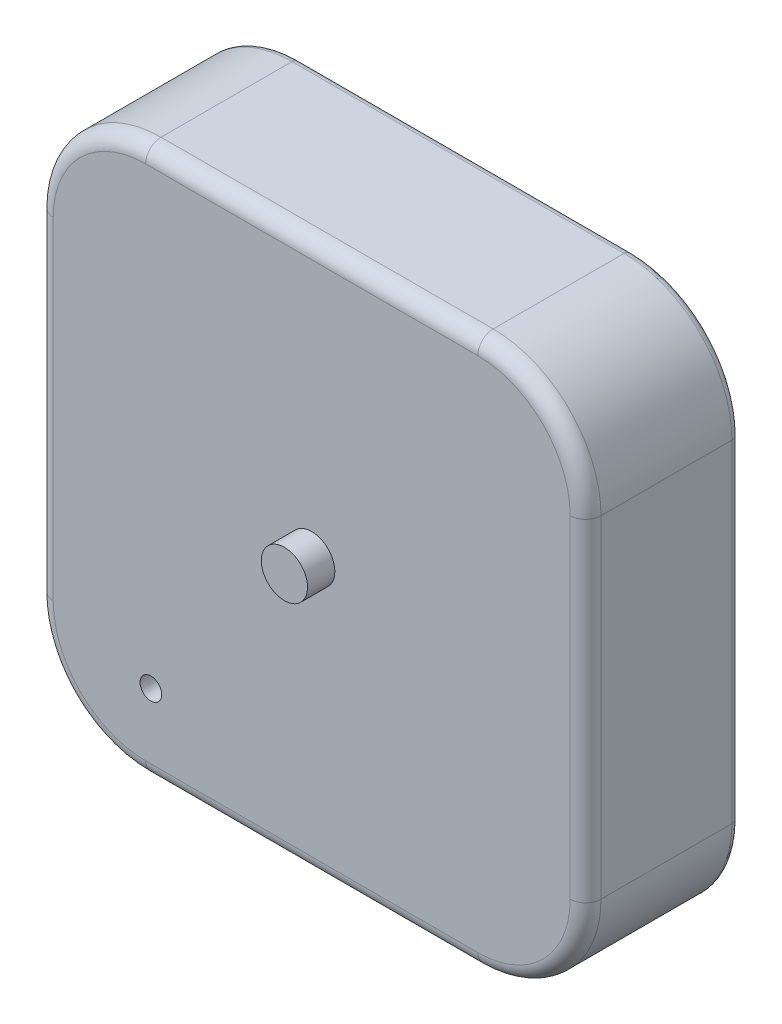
from build123d import *

# Parameters (mm, degrees)
SKETCH1_W           = 355.6
SKETCH1_H           = 355.6
BOSS_EXTRUDE1_DEPTH = 100
FILLET1_R           = 70
SKETCH2_R           = 7.03
CUT_EXTRUDE1_DEPTH  = 25.04
FILLET3_R           = 5
FILLET4_R           = 10
SKETCH3_R           = 15
BOSS_EXTRUDE2_DEPTH = 17.7


with BuildPart() as part:
    # Sketch1 → Boss-Extrude1 (new body)
    with BuildSketch(Plane.XY):
        Rectangle(SKETCH1_W, SKETCH1_H)
    extrude(amount=BOSS_EXTRUDE1_DEPTH)

    # Fillet1
    fillet1_edges = [part.edges().sort_by_distance(p)[0] for p in [
        (-177.8, -177.8, 50),
        (-177.8, 177.8, 50),
        (177.8, 177.8, 50),
        (177.8, -177.8, 50),
    ]]
    fillet(fillet1_edges, radius=FILLET1_R)

    # Sketch2 → Cut-Extrude1 (cut)
    with BuildSketch(Plane.XY.offset(100)):
        with Locations((-104.42, -125.46)):
            Circle(SKETCH2_R)
    extrude(amount=-CUT_EXTRUDE1_DEPTH, mode=Mode.SUBTRACT)

    # Fillet3
    fillet3_edges = [part.edges().sort_by_distance(p)[0] for p in [
        (0, 177.8, 0),
        (177.8, 0, 0),
        (0, -177.8, 0),
        (-177.8, 0, 0),
        (-157.297474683, 157.297474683, 0),
        (-157.297474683, -157.297474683, 0),
        (157.297474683, -157.297474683, 0),
        (157.297474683, 157.297474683, 0),
    ]]
    fillet(fillet3_edges, radius=FILLET3_R)

    # Fillet4
    fillet4_edges = [part.edges().sort_by_distance(p)[0] for p in [
        (0, 177.8, 100),
        (177.8, 0, 100),
        (-177.8, 0, 100),
        (0, -177.8, 100),
        (-157.297474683, 157.297474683, 100),
        (-157.297474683, -157.297474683, 100),
        (157.297474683, -157.297474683, 100),
        (157.297474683, 157.297474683, 100),
    ]]
    fillet(fillet4_edges, radius=FILLET4_R)

    # Sketch3 → Boss-Extrude2 (add)
    with BuildSketch(Plane.XY.offset(100)):
        Circle(SKETCH3_R)
    extrude(amount=BOSS_EXTRUDE2_DEPTH)


solid = part.part
